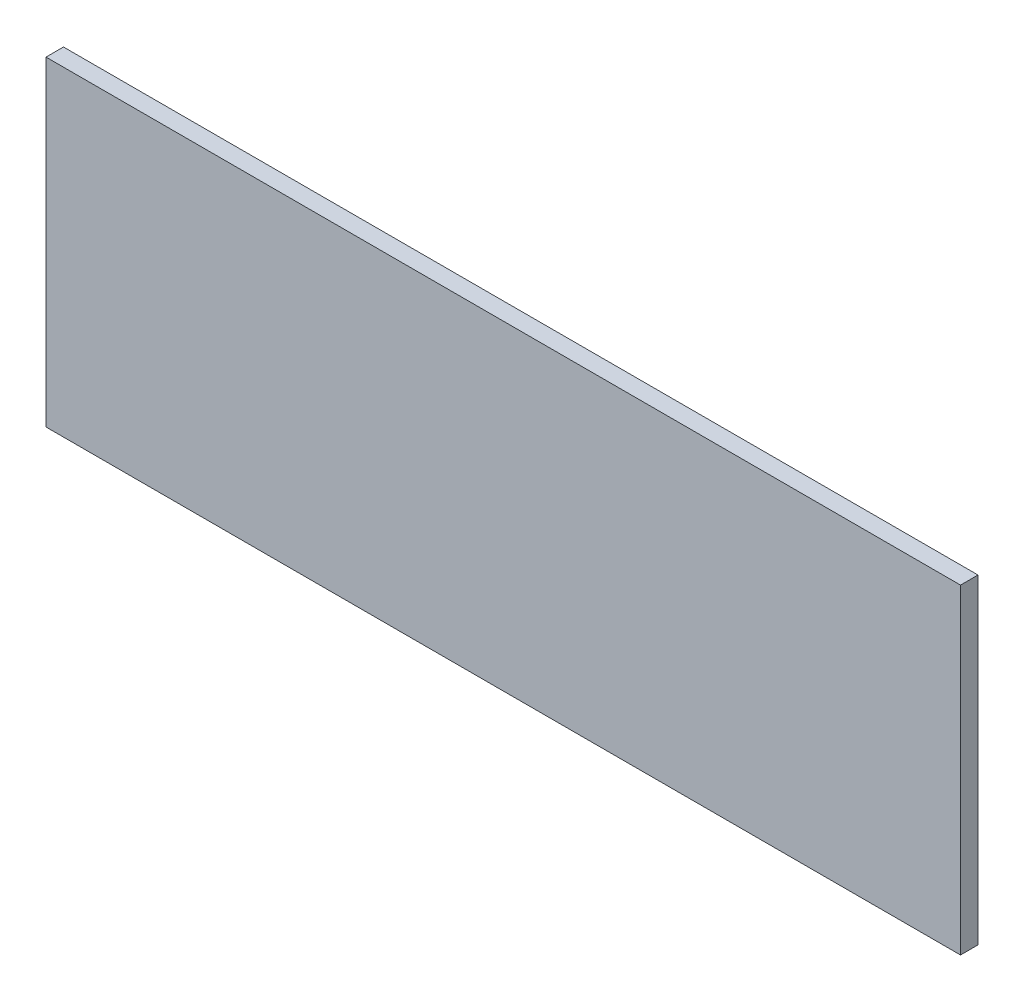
from build123d import *

# Parameters (mm, degrees)
SKETCH1_W      = 79.756
SKETCH1_H      = 27.94
EXTRUDE1_DEPTH = 1.524


with BuildPart() as part:
    # Sketch1 → Extrude1 (new body)
    with BuildSketch(Plane.XY):
        with Locations((-7.224646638, 0.843032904)):
            Rectangle(SKETCH1_W, SKETCH1_H)
    extrude(amount=EXTRUDE1_DEPTH)


solid = part.part
